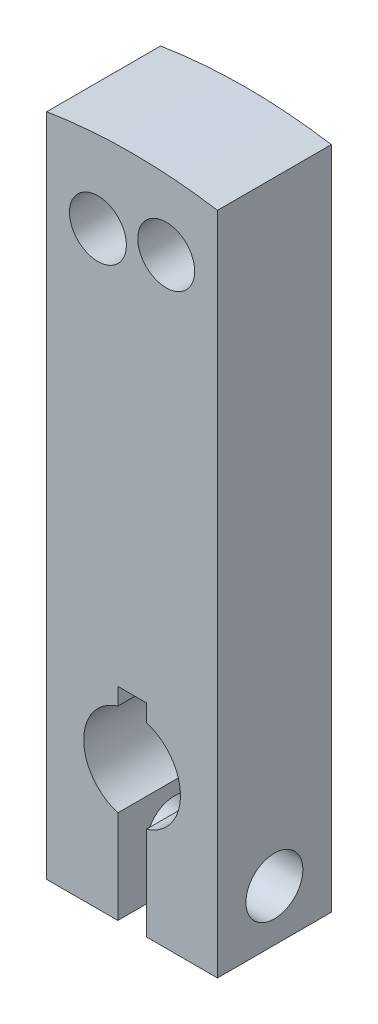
from build123d import *

# Parameters (mm, degrees)
BASE_EXTRUSION_DEPTH         = 20
ENL_V_MAT_EXTRU_1_DEPTH      = 20
ENL_V_MAT_EXTRU_1_DEPTH_BACK = 20
ESQUISSE2_R                  = 5
ESQUISSE3_R                  = 5
ENL_V_MAT_EXTRU_2_DEPTH      = 97.784554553


with BuildPart() as part:
    # Esquisse1 → Base-Extrusion (new body)
    with BuildSketch(Plane.XY):
        with BuildLine():
            Line((-15, 92.288948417), (-15, -24.5))
            Line((-15, -24.5), (-2.5, -24.5))
            Line((-2.5, -24.5), (-2.5, -8.124038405))
            ThreePointArc((-2.5, -8.124038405), (-8.5, 0), (-2.5, 8.124038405))
            Line((-2.5, 8.124038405), (-2.5, 11.124038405))
            Line((-2.5, 11.124038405), (2.5, 11.124038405))
            Line((2.5, 11.124038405), (2.5, 8.124038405))
            ThreePointArc((2.5, 8.124038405), (8.5, 0), (2.5, -8.124038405))
            Line((2.5, -8.124038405), (2.5, -24.5))
            Line((2.5, -24.5), (15, -24.5))
            Line((15, -24.5), (15, 92.288948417))
            ThreePointArc((15, 92.288948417), (0, 93.5), (-15, 92.288948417))
        make_face()
    extrude(amount=-BASE_EXTRUSION_DEPTH)

    # Esquisse2 → Enl_v. mat.-Extru.1 (cut, two sides: drawn at the far end of the back side and taken through both)
    with BuildSketch(Plane(origin=(0, 0, 0), x_dir=(0, 0, -1), z_dir=(1, 0, 0)).offset(-ENL_V_MAT_EXTRU_1_DEPTH_BACK)):
        with Locations(Location((10, -15.5, 0), (0, 0, 90))):
            Circle(ESQUISSE2_R)
    extrude(amount=ENL_V_MAT_EXTRU_1_DEPTH + ENL_V_MAT_EXTRU_1_DEPTH_BACK, mode=Mode.SUBTRACT)

    # Esquisse3 → Enl_v. mat.-Extru.2 (cut, through all)
    with BuildSketch(Plane.XY):
        with Locations((6, 81)):
            Circle(ESQUISSE3_R)
        with Locations((-6, 79)):
            Circle(ESQUISSE3_R)
    extrude(amount=-ENL_V_MAT_EXTRU_2_DEPTH, mode=Mode.SUBTRACT)


solid = part.part
